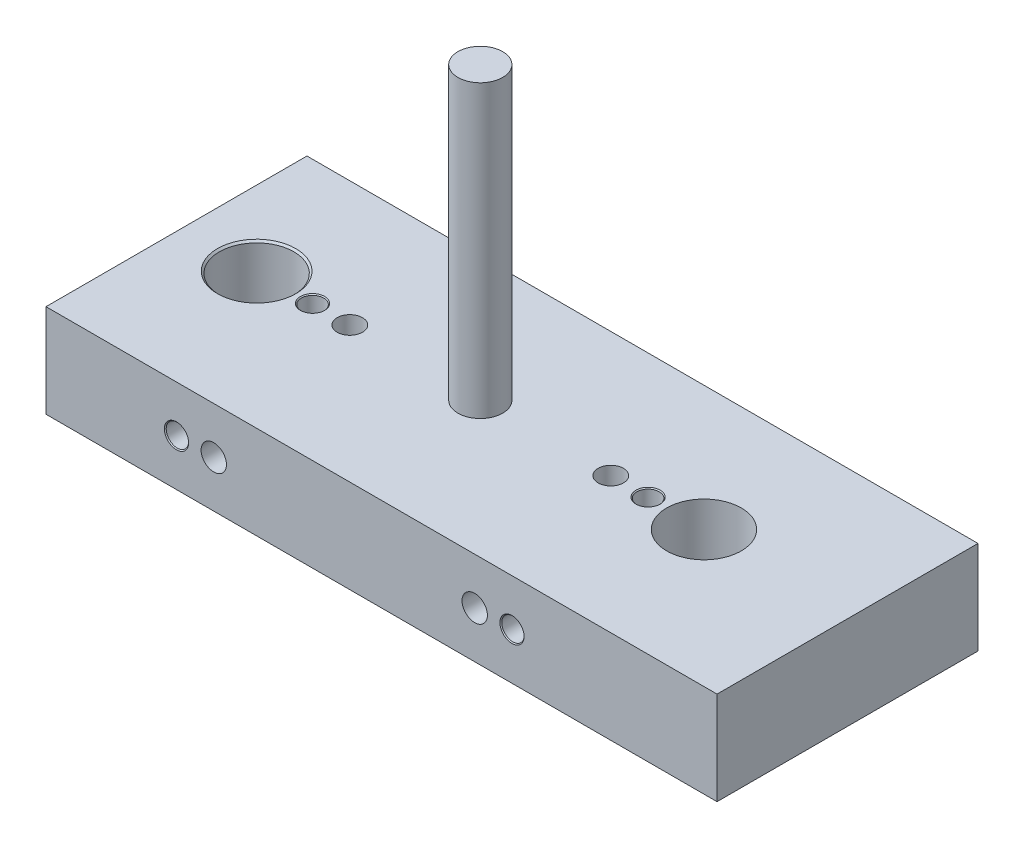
ISO-10303-21;
HEADER;
FILE_DESCRIPTION(('STEP AP214'),'2;1');
FILE_NAME('part.step','',(''),(''),'','','');
FILE_SCHEMA(('AUTOMOTIVE_DESIGN { 1 0 10303 214 1 1 1 1 }'));
ENDSEC;
DATA;
#1=APPLICATION_CONTEXT('core data for automotive mechanical design processes');
#2=APPLICATION_PROTOCOL_DEFINITION('international standard','automotive_design',2000,#1);
#3=PRODUCT_CONTEXT('',#1,'mechanical');
#4=PRODUCT('Part','Part','',(#3));
#5=PRODUCT_RELATED_PRODUCT_CATEGORY('part','',(#4));
#6=PRODUCT_DEFINITION_FORMATION('','',#4);
#7=PRODUCT_DEFINITION_CONTEXT('part definition',#1,'design');
#8=PRODUCT_DEFINITION('design','',#6,#7);
#9=PRODUCT_DEFINITION_SHAPE('','',#8);
#10=(LENGTH_UNIT() NAMED_UNIT(*) SI_UNIT(.MILLI.,.METRE.));
#11=(NAMED_UNIT(*) PLANE_ANGLE_UNIT() SI_UNIT($,.RADIAN.));
#12=(NAMED_UNIT(*) SI_UNIT($,.STERADIAN.) SOLID_ANGLE_UNIT());
#13=UNCERTAINTY_MEASURE_WITH_UNIT(LENGTH_MEASURE(1.E-05),#10,'distance_accuracy_value','');
#14=(GEOMETRIC_REPRESENTATION_CONTEXT(3) GLOBAL_UNCERTAINTY_ASSIGNED_CONTEXT((#13)) GLOBAL_UNIT_ASSIGNED_CONTEXT((#10,
#11,#12)) REPRESENTATION_CONTEXT('',''));
#15=CARTESIAN_POINT('',(0.,0.,0.));
#16=DIRECTION('',(0.,0.,1.));
#17=DIRECTION('',(1.,0.,0.));
#18=AXIS2_PLACEMENT_3D('',#15,#16,#17);
#19=CARTESIAN_POINT('',(0.,25.,-70.));
#20=DIRECTION('',(0.,-1.,0.));
#21=DIRECTION('',(0.,0.,-1.));
#22=AXIS2_PLACEMENT_3D('',#19,#20,#21);
#23=PLANE('',#22);
#24=CARTESIAN_POINT('',(140.,25.,-36.5));
#25=DIRECTION('',(0.,-1.,0.));
#26=DIRECTION('',(0.,0.,-1.));
#27=AXIS2_PLACEMENT_3D('',#24,#25,#26);
#28=CIRCLE('',#27,9.99999999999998);
#29=CARTESIAN_POINT('',(140.,25.,-46.5));
#30=VERTEX_POINT('',#29);
#31=EDGE_CURVE('E9179',#30,#30,#28,.T.);
#32=ORIENTED_EDGE('',*,*,#31,.T.);
#33=EDGE_LOOP('',(#32));
#34=FACE_BOUND('',#33,.T.);
#35=DIRECTION('',(0.,0.,1.));
#36=VECTOR('',#35,1.);
#37=CARTESIAN_POINT('',(0.,25.,0.));
#38=LINE('',#37,#36);
#39=CARTESIAN_POINT('',(0.,25.,-70.));
#40=VERTEX_POINT('',#39);
#41=CARTESIAN_POINT('',(0.,25.,0.));
#42=VERTEX_POINT('',#41);
#43=EDGE_CURVE('E9307',#40,#42,#38,.T.);
#44=ORIENTED_EDGE('',*,*,#43,.T.);
#45=DIRECTION('',(1.,0.,0.));
#46=VECTOR('',#45,1.);
#47=CARTESIAN_POINT('',(0.,25.,0.));
#48=LINE('',#47,#46);
#49=CARTESIAN_POINT('',(180.,25.,0.));
#50=VERTEX_POINT('',#49);
#51=EDGE_CURVE('E9305',#42,#50,#48,.T.);
#52=ORIENTED_EDGE('',*,*,#51,.T.);
#53=DIRECTION('',(0.,0.,-1.));
#54=VECTOR('',#53,1.);
#55=CARTESIAN_POINT('',(180.,25.,0.));
#56=LINE('',#55,#54);
#57=CARTESIAN_POINT('',(180.,25.,-70.));
#58=VERTEX_POINT('',#57);
#59=EDGE_CURVE('E9303',#50,#58,#56,.T.);
#60=ORIENTED_EDGE('',*,*,#59,.T.);
#61=DIRECTION('',(-1.,0.,0.));
#62=VECTOR('',#61,1.);
#63=CARTESIAN_POINT('',(0.,25.,-70.));
#64=LINE('',#63,#62);
#65=EDGE_CURVE('E9301',#58,#40,#64,.T.);
#66=ORIENTED_EDGE('',*,*,#65,.T.);
#67=EDGE_LOOP('',(#44,#52,#60,#66));
#68=FACE_BOUND('',#67,.T.);
#69=CARTESIAN_POINT('',(20.,25.,-36.5));
#70=DIRECTION('',(0.,-1.,0.));
#71=DIRECTION('',(0.,0.,-1.));
#72=AXIS2_PLACEMENT_3D('',#69,#70,#71);
#73=CIRCLE('',#72,10.5);
#74=CARTESIAN_POINT('',(20.,25.,-47.));
#75=VERTEX_POINT('',#74);
#76=EDGE_CURVE('E9328',#75,#75,#73,.T.);
#77=ORIENTED_EDGE('',*,*,#76,.T.);
#78=EDGE_LOOP('',(#77));
#79=FACE_BOUND('',#78,.T.);
#80=CARTESIAN_POINT('',(45.,25.,-36.5));
#81=DIRECTION('',(0.,-1.,0.));
#82=DIRECTION('',(0.,0.,-1.));
#83=AXIS2_PLACEMENT_3D('',#80,#81,#82);
#84=CIRCLE('',#83,3.39999999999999);
#85=CARTESIAN_POINT('',(45.,25.,-39.9));
#86=VERTEX_POINT('',#85);
#87=EDGE_CURVE('E9334',#86,#86,#84,.T.);
#88=ORIENTED_EDGE('',*,*,#87,.T.);
#89=EDGE_LOOP('',(#88));
#90=FACE_BOUND('',#89,.T.);
#91=CARTESIAN_POINT('',(115.,25.,-36.5));
#92=DIRECTION('',(0.,-1.,0.));
#93=DIRECTION('',(0.,0.,-1.));
#94=AXIS2_PLACEMENT_3D('',#91,#92,#93);
#95=CIRCLE('',#94,3.4);
#96=CARTESIAN_POINT('',(115.,25.,-39.9));
#97=VERTEX_POINT('',#96);
#98=EDGE_CURVE('E9340',#97,#97,#95,.T.);
#99=ORIENTED_EDGE('',*,*,#98,.T.);
#100=EDGE_LOOP('',(#99));
#101=FACE_BOUND('',#100,.T.);
#102=CARTESIAN_POINT('',(35.,25.,-36.5));
#103=DIRECTION('',(0.,-1.,0.));
#104=DIRECTION('',(0.,0.,-1.));
#105=AXIS2_PLACEMENT_3D('',#102,#103,#104);
#106=CIRCLE('',#105,3.25);
#107=CARTESIAN_POINT('',(35.,25.,-39.75));
#108=VERTEX_POINT('',#107);
#109=EDGE_CURVE('E9352',#108,#108,#106,.T.);
#110=ORIENTED_EDGE('',*,*,#109,.T.);
#111=EDGE_LOOP('',(#110));
#112=FACE_BOUND('',#111,.T.);
#113=CARTESIAN_POINT('',(125.,25.,-36.5));
#114=DIRECTION('',(0.,-1.,0.));
#115=DIRECTION('',(0.,0.,-1.));
#116=AXIS2_PLACEMENT_3D('',#113,#114,#115);
#117=CIRCLE('',#116,3.25);
#118=CARTESIAN_POINT('',(125.,25.,-39.75));
#119=VERTEX_POINT('',#118);
#120=EDGE_CURVE('E9364',#119,#119,#117,.T.);
#121=ORIENTED_EDGE('',*,*,#120,.T.);
#122=EDGE_LOOP('',(#121));
#123=FACE_BOUND('',#122,.T.);
#124=CARTESIAN_POINT('',(80.,25.,-36.5));
#125=DIRECTION('',(0.,-1.,0.));
#126=DIRECTION('',(0.,0.,-1.));
#127=AXIS2_PLACEMENT_3D('',#124,#125,#126);
#128=CIRCLE('',#127,6.);
#129=CARTESIAN_POINT('',(80.,25.,-42.5));
#130=VERTEX_POINT('',#129);
#131=EDGE_CURVE('E11',#130,#130,#128,.F.);
#132=ORIENTED_EDGE('',*,*,#131,.F.);
#133=EDGE_LOOP('',(#132));
#134=FACE_BOUND('',#133,.T.);
#135=ADVANCED_FACE('F9175',(#34,#68,#79,#90,#101,#112,#123,#134),#23,.F.);
#136=CARTESIAN_POINT('',(115.,0.,-36.5));
#137=DIRECTION('',(0.,-1.,0.));
#138=DIRECTION('',(0.,0.,-1.));
#139=AXIS2_PLACEMENT_3D('',#136,#137,#138);
#140=CYLINDRICAL_SURFACE('',#139,3.4);
#141=CARTESIAN_POINT('',(115.,0.,-36.5));
#142=DIRECTION('',(0.,-1.,0.));
#143=DIRECTION('',(0.,0.,-1.));
#144=AXIS2_PLACEMENT_3D('',#141,#142,#143);
#145=CIRCLE('',#144,3.4);
#146=CARTESIAN_POINT('',(115.,0.,-39.9));
#147=VERTEX_POINT('',#146);
#148=EDGE_CURVE('E9337',#147,#147,#145,.T.);
#149=ORIENTED_EDGE('',*,*,#148,.T.);
#150=EDGE_LOOP('',(#149));
#151=FACE_BOUND('',#150,.T.);
#152=CARTESIAN_POINT('',(115.,12.5,-36.5));
#153=DIRECTION('',(0.,-0.707106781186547,-0.707106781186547));
#154=DIRECTION('',(0.,-0.707106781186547,0.707106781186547));
#155=AXIS2_PLACEMENT_3D('',#152,#153,#154);
#156=ELLIPSE('',#155,4.80832611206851,3.39999999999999);
#157=CARTESIAN_POINT('',(111.6,12.5,-36.5));
#158=VERTEX_POINT('',#157);
#159=CARTESIAN_POINT('',(118.4,12.5,-36.5));
#160=VERTEX_POINT('',#159);
#161=EDGE_CURVE('E9190',#158,#160,#156,.F.);
#162=ORIENTED_EDGE('',*,*,#161,.T.);
#163=CARTESIAN_POINT('',(115.,12.5,-36.5));
#164=DIRECTION('',(0.,-0.707106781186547,0.707106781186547));
#165=DIRECTION('',(0.,-0.707106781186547,-0.707106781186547));
#166=AXIS2_PLACEMENT_3D('',#163,#164,#165);
#167=ELLIPSE('',#166,4.80832611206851,3.39999999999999);
#168=EDGE_CURVE('E9184',#160,#158,#167,.F.);
#169=ORIENTED_EDGE('',*,*,#168,.T.);
#170=EDGE_LOOP('',(#162,#169));
#171=FACE_BOUND('',#170,.T.);
#172=ADVANCED_FACE('F9253',(#151,#171),#140,.F.);
#173=CARTESIAN_POINT('',(45.,0.,-36.5));
#174=DIRECTION('',(0.,-1.,0.));
#175=DIRECTION('',(0.,0.,-1.));
#176=AXIS2_PLACEMENT_3D('',#173,#174,#175);
#177=CYLINDRICAL_SURFACE('',#176,3.4);
#178=CARTESIAN_POINT('',(45.,0.,-36.5));
#179=DIRECTION('',(0.,-1.,0.));
#180=DIRECTION('',(0.,0.,-1.));
#181=AXIS2_PLACEMENT_3D('',#178,#179,#180);
#182=CIRCLE('',#181,3.4);
#183=CARTESIAN_POINT('',(45.,0.,-39.9));
#184=VERTEX_POINT('',#183);
#185=EDGE_CURVE('E9331',#184,#184,#182,.T.);
#186=ORIENTED_EDGE('',*,*,#185,.T.);
#187=EDGE_LOOP('',(#186));
#188=FACE_BOUND('',#187,.T.);
#189=CARTESIAN_POINT('',(45.,12.5,-36.5));
#190=DIRECTION('',(0.,-0.707106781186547,-0.707106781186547));
#191=DIRECTION('',(0.,-0.707106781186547,0.707106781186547));
#192=AXIS2_PLACEMENT_3D('',#189,#190,#191);
#193=ELLIPSE('',#192,4.80832611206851,3.39999999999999);
#194=CARTESIAN_POINT('',(41.6,12.5,-36.5));
#195=VERTEX_POINT('',#194);
#196=CARTESIAN_POINT('',(48.4,12.5,-36.5));
#197=VERTEX_POINT('',#196);
#198=EDGE_CURVE('E9197',#195,#197,#193,.F.);
#199=ORIENTED_EDGE('',*,*,#198,.T.);
#200=CARTESIAN_POINT('',(45.,12.5,-36.5));
#201=DIRECTION('',(0.,-0.707106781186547,0.707106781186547));
#202=DIRECTION('',(0.,-0.707106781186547,-0.707106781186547));
#203=AXIS2_PLACEMENT_3D('',#200,#201,#202);
#204=ELLIPSE('',#203,4.80832611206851,3.39999999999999);
#205=EDGE_CURVE('E9251',#197,#195,#204,.F.);
#206=ORIENTED_EDGE('',*,*,#205,.T.);
#207=EDGE_LOOP('',(#199,#206));
#208=FACE_BOUND('',#207,.T.);
#209=ADVANCED_FACE('F9550',(#188,#208),#177,.F.);
#210=CARTESIAN_POINT('',(125.,0.,-36.5));
#211=DIRECTION('',(0.,-1.,0.));
#212=DIRECTION('',(0.,0.,-1.));
#213=AXIS2_PLACEMENT_3D('',#210,#211,#212);
#214=CYLINDRICAL_SURFACE('',#213,3.);
#215=CARTESIAN_POINT('',(125.,0.250000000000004,-36.5));
#216=DIRECTION('',(0.,-1.,0.));
#217=DIRECTION('',(0.,0.,-1.));
#218=AXIS2_PLACEMENT_3D('',#215,#216,#217);
#219=CIRCLE('',#218,3.);
#220=CARTESIAN_POINT('',(125.,0.250000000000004,-39.5));
#221=VERTEX_POINT('',#220);
#222=EDGE_CURVE('E9358',#221,#221,#219,.T.);
#223=ORIENTED_EDGE('',*,*,#222,.T.);
#224=EDGE_LOOP('',(#223));
#225=FACE_BOUND('',#224,.T.);
#226=CARTESIAN_POINT('',(125.,12.5,-36.5));
#227=DIRECTION('',(0.,-0.707106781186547,-0.707106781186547));
#228=DIRECTION('',(0.,-0.707106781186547,0.707106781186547));
#229=AXIS2_PLACEMENT_3D('',#226,#227,#228);
#230=ELLIPSE('',#229,4.24264068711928,3.);
#231=CARTESIAN_POINT('',(122.,12.5,-36.5));
#232=VERTEX_POINT('',#231);
#233=CARTESIAN_POINT('',(128.,12.5,-36.5));
#234=VERTEX_POINT('',#233);
#235=EDGE_CURVE('E9276',#232,#234,#230,.F.);
#236=ORIENTED_EDGE('',*,*,#235,.T.);
#237=CARTESIAN_POINT('',(125.,12.5,-36.5));
#238=DIRECTION('',(0.,-0.707106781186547,0.707106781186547));
#239=DIRECTION('',(0.,-0.707106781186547,-0.707106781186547));
#240=AXIS2_PLACEMENT_3D('',#237,#238,#239);
#241=ELLIPSE('',#240,4.24264068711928,3.);
#242=EDGE_CURVE('E9267',#234,#232,#241,.F.);
#243=ORIENTED_EDGE('',*,*,#242,.T.);
#244=EDGE_LOOP('',(#236,#243));
#245=FACE_BOUND('',#244,.T.);
#246=ADVANCED_FACE('F9526',(#225,#245),#214,.F.);
#247=CARTESIAN_POINT('',(35.,0.,-36.5));
#248=DIRECTION('',(0.,-1.,0.));
#249=DIRECTION('',(0.,0.,-1.));
#250=AXIS2_PLACEMENT_3D('',#247,#248,#249);
#251=CYLINDRICAL_SURFACE('',#250,3.);
#252=CARTESIAN_POINT('',(35.,0.250000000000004,-36.5));
#253=DIRECTION('',(0.,-1.,0.));
#254=DIRECTION('',(0.,0.,-1.));
#255=AXIS2_PLACEMENT_3D('',#252,#253,#254);
#256=CIRCLE('',#255,3.);
#257=CARTESIAN_POINT('',(35.,0.250000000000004,-39.5));
#258=VERTEX_POINT('',#257);
#259=EDGE_CURVE('E9346',#258,#258,#256,.T.);
#260=ORIENTED_EDGE('',*,*,#259,.T.);
#261=EDGE_LOOP('',(#260));
#262=FACE_BOUND('',#261,.T.);
#263=CARTESIAN_POINT('',(35.,12.5,-36.5));
#264=DIRECTION('',(0.,-0.707106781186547,-0.707106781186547));
#265=DIRECTION('',(0.,-0.707106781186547,0.707106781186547));
#266=AXIS2_PLACEMENT_3D('',#263,#264,#265);
#267=ELLIPSE('',#266,4.24264068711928,2.99999999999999);
#268=CARTESIAN_POINT('',(32.,12.5,-36.5));
#269=VERTEX_POINT('',#268);
#270=CARTESIAN_POINT('',(38.,12.5,-36.5));
#271=VERTEX_POINT('',#270);
#272=EDGE_CURVE('E9287',#269,#271,#267,.F.);
#273=ORIENTED_EDGE('',*,*,#272,.T.);
#274=CARTESIAN_POINT('',(35.,12.5,-36.5));
#275=DIRECTION('',(0.,-0.707106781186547,0.707106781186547));
#276=DIRECTION('',(0.,-0.707106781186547,-0.707106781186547));
#277=AXIS2_PLACEMENT_3D('',#274,#275,#276);
#278=ELLIPSE('',#277,4.24264068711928,2.99999999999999);
#279=EDGE_CURVE('E9278',#271,#269,#278,.F.);
#280=ORIENTED_EDGE('',*,*,#279,.T.);
#281=EDGE_LOOP('',(#273,#280));
#282=FACE_BOUND('',#281,.T.);
#283=ADVANCED_FACE('F9539',(#262,#282),#251,.F.);
#284=CARTESIAN_POINT('',(0.,25.,0.));
#285=DIRECTION('',(1.,0.,0.));
#286=DIRECTION('',(0.,0.,-1.));
#287=AXIS2_PLACEMENT_3D('',#284,#285,#286);
#288=PLANE('',#287);
#289=DIRECTION('',(0.,0.,1.));
#290=VECTOR('',#289,1.);
#291=CARTESIAN_POINT('',(0.,0.,0.));
#292=LINE('',#291,#290);
#293=CARTESIAN_POINT('',(0.,0.,-70.));
#294=VERTEX_POINT('',#293);
#295=CARTESIAN_POINT('',(0.,0.,0.));
#296=VERTEX_POINT('',#295);
#297=EDGE_CURVE('E9316',#294,#296,#292,.T.);
#298=ORIENTED_EDGE('',*,*,#297,.T.);
#299=DIRECTION('',(0.,-1.,0.));
#300=VECTOR('',#299,1.);
#301=CARTESIAN_POINT('',(0.,25.,0.));
#302=LINE('',#301,#300);
#303=EDGE_CURVE('E9289',#42,#296,#302,.T.);
#304=ORIENTED_EDGE('',*,*,#303,.F.);
#305=ORIENTED_EDGE('',*,*,#43,.F.);
#306=DIRECTION('',(0.,-1.,0.));
#307=VECTOR('',#306,1.);
#308=CARTESIAN_POINT('',(0.,25.,-70.));
#309=LINE('',#308,#307);
#310=EDGE_CURVE('E9298',#40,#294,#309,.T.);
#311=ORIENTED_EDGE('',*,*,#310,.T.);
#312=EDGE_LOOP('',(#298,#304,#305,#311));
#313=FACE_BOUND('',#312,.T.);
#314=ADVANCED_FACE('F9177',(#313),#288,.F.);
#315=CARTESIAN_POINT('',(0.,25.,0.));
#316=DIRECTION('',(0.,0.,-1.));
#317=DIRECTION('',(-1.,0.,0.));
#318=AXIS2_PLACEMENT_3D('',#315,#316,#317);
#319=PLANE('',#318);
#320=CARTESIAN_POINT('',(115.,12.5,0.));
#321=DIRECTION('',(0.,0.,1.));
#322=DIRECTION('',(1.,0.,0.));
#323=AXIS2_PLACEMENT_3D('',#320,#321,#322);
#324=CIRCLE('',#323,3.39999999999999);
#325=CARTESIAN_POINT('',(118.4,12.5,0.));
#326=VERTEX_POINT('',#325);
#327=EDGE_CURVE('E9397',#326,#326,#324,.T.);
#328=ORIENTED_EDGE('',*,*,#327,.F.);
#329=EDGE_LOOP('',(#328));
#330=FACE_BOUND('',#329,.T.);
#331=CARTESIAN_POINT('',(45.,12.5,0.));
#332=DIRECTION('',(0.,0.,1.));
#333=DIRECTION('',(1.,0.,0.));
#334=AXIS2_PLACEMENT_3D('',#331,#332,#333);
#335=CIRCLE('',#334,3.39999999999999);
#336=CARTESIAN_POINT('',(48.4,12.5,0.));
#337=VERTEX_POINT('',#336);
#338=EDGE_CURVE('E9391',#337,#337,#335,.T.);
#339=ORIENTED_EDGE('',*,*,#338,.F.);
#340=EDGE_LOOP('',(#339));
#341=FACE_BOUND('',#340,.T.);
#342=CARTESIAN_POINT('',(125.,12.5,0.));
#343=DIRECTION('',(0.,0.,1.));
#344=DIRECTION('',(1.,0.,0.));
#345=AXIS2_PLACEMENT_3D('',#342,#343,#344);
#346=CIRCLE('',#345,3.25);
#347=CARTESIAN_POINT('',(128.25,12.5,0.));
#348=VERTEX_POINT('',#347);
#349=EDGE_CURVE('E9379',#348,#348,#346,.T.);
#350=ORIENTED_EDGE('',*,*,#349,.F.);
#351=EDGE_LOOP('',(#350));
#352=FACE_BOUND('',#351,.T.);
#353=CARTESIAN_POINT('',(35.,12.5,0.));
#354=DIRECTION('',(0.,0.,1.));
#355=DIRECTION('',(1.,0.,0.));
#356=AXIS2_PLACEMENT_3D('',#353,#354,#355);
#357=CIRCLE('',#356,3.25);
#358=CARTESIAN_POINT('',(38.25,12.5,0.));
#359=VERTEX_POINT('',#358);
#360=EDGE_CURVE('E9367',#359,#359,#357,.T.);
#361=ORIENTED_EDGE('',*,*,#360,.F.);
#362=EDGE_LOOP('',(#361));
#363=FACE_BOUND('',#362,.T.);
#364=DIRECTION('',(1.,0.,0.));
#365=VECTOR('',#364,1.);
#366=CARTESIAN_POINT('',(0.,0.,0.));
#367=LINE('',#366,#365);
#368=CARTESIAN_POINT('',(180.,0.,0.));
#369=VERTEX_POINT('',#368);
#370=EDGE_CURVE('E9314',#296,#369,#367,.T.);
#371=ORIENTED_EDGE('',*,*,#370,.T.);
#372=DIRECTION('',(0.,-1.,0.));
#373=VECTOR('',#372,1.);
#374=CARTESIAN_POINT('',(180.,25.,0.));
#375=LINE('',#374,#373);
#376=EDGE_CURVE('E9292',#50,#369,#375,.T.);
#377=ORIENTED_EDGE('',*,*,#376,.F.);
#378=ORIENTED_EDGE('',*,*,#51,.F.);
#379=ORIENTED_EDGE('',*,*,#303,.T.);
#380=EDGE_LOOP('',(#371,#377,#378,#379));
#381=FACE_BOUND('',#380,.T.);
#382=ADVANCED_FACE('F9453',(#330,#341,#352,#363,#381),#319,.F.);
#383=CARTESIAN_POINT('',(180.,25.,0.));
#384=DIRECTION('',(-1.,0.,0.));
#385=DIRECTION('',(0.,0.,1.));
#386=AXIS2_PLACEMENT_3D('',#383,#384,#385);
#387=PLANE('',#386);
#388=DIRECTION('',(0.,0.,-1.));
#389=VECTOR('',#388,1.);
#390=CARTESIAN_POINT('',(180.,0.,0.));
#391=LINE('',#390,#389);
#392=CARTESIAN_POINT('',(180.,0.,-70.));
#393=VERTEX_POINT('',#392);
#394=EDGE_CURVE('E9312',#369,#393,#391,.T.);
#395=ORIENTED_EDGE('',*,*,#394,.T.);
#396=DIRECTION('',(0.,-1.,0.));
#397=VECTOR('',#396,1.);
#398=CARTESIAN_POINT('',(180.,25.,-70.));
#399=LINE('',#398,#397);
#400=EDGE_CURVE('E9295',#58,#393,#399,.T.);
#401=ORIENTED_EDGE('',*,*,#400,.F.);
#402=ORIENTED_EDGE('',*,*,#59,.F.);
#403=ORIENTED_EDGE('',*,*,#376,.T.);
#404=EDGE_LOOP('',(#395,#401,#402,#403));
#405=FACE_BOUND('',#404,.T.);
#406=ADVANCED_FACE('F9450',(#405),#387,.F.);
#407=CARTESIAN_POINT('',(0.,25.,-70.));
#408=DIRECTION('',(0.,0.,1.));
#409=DIRECTION('',(1.,0.,0.));
#410=AXIS2_PLACEMENT_3D('',#407,#408,#409);
#411=PLANE('',#410);
#412=CARTESIAN_POINT('',(115.,12.5,-70.));
#413=DIRECTION('',(0.,0.,1.));
#414=DIRECTION('',(1.,0.,0.));
#415=AXIS2_PLACEMENT_3D('',#412,#413,#414);
#416=CIRCLE('',#415,3.39999999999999);
#417=CARTESIAN_POINT('',(118.4,12.5,-70.));
#418=VERTEX_POINT('',#417);
#419=EDGE_CURVE('E9400',#418,#418,#416,.T.);
#420=ORIENTED_EDGE('',*,*,#419,.T.);
#421=EDGE_LOOP('',(#420));
#422=FACE_BOUND('',#421,.T.);
#423=CARTESIAN_POINT('',(45.,12.5,-70.));
#424=DIRECTION('',(0.,0.,1.));
#425=DIRECTION('',(1.,0.,0.));
#426=AXIS2_PLACEMENT_3D('',#423,#424,#425);
#427=CIRCLE('',#426,3.39999999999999);
#428=CARTESIAN_POINT('',(48.4,12.5,-70.));
#429=VERTEX_POINT('',#428);
#430=EDGE_CURVE('E9394',#429,#429,#427,.T.);
#431=ORIENTED_EDGE('',*,*,#430,.T.);
#432=EDGE_LOOP('',(#431));
#433=FACE_BOUND('',#432,.T.);
#434=CARTESIAN_POINT('',(125.,12.5,-70.));
#435=DIRECTION('',(0.,0.,1.));
#436=DIRECTION('',(1.,0.,0.));
#437=AXIS2_PLACEMENT_3D('',#434,#435,#436);
#438=CIRCLE('',#437,3.24999999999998);
#439=CARTESIAN_POINT('',(128.25,12.5,-70.));
#440=VERTEX_POINT('',#439);
#441=EDGE_CURVE('E9388',#440,#440,#438,.T.);
#442=ORIENTED_EDGE('',*,*,#441,.T.);
#443=EDGE_LOOP('',(#442));
#444=FACE_BOUND('',#443,.T.);
#445=CARTESIAN_POINT('',(35.,12.5,-70.));
#446=DIRECTION('',(0.,0.,1.));
#447=DIRECTION('',(1.,0.,0.));
#448=AXIS2_PLACEMENT_3D('',#445,#446,#447);
#449=CIRCLE('',#448,3.24999999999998);
#450=CARTESIAN_POINT('',(38.25,12.5,-70.));
#451=VERTEX_POINT('',#450);
#452=EDGE_CURVE('E9376',#451,#451,#449,.T.);
#453=ORIENTED_EDGE('',*,*,#452,.T.);
#454=EDGE_LOOP('',(#453));
#455=FACE_BOUND('',#454,.T.);
#456=DIRECTION('',(-1.,0.,0.));
#457=VECTOR('',#456,1.);
#458=CARTESIAN_POINT('',(0.,0.,-70.));
#459=LINE('',#458,#457);
#460=EDGE_CURVE('E9310',#393,#294,#459,.T.);
#461=ORIENTED_EDGE('',*,*,#460,.T.);
#462=ORIENTED_EDGE('',*,*,#310,.F.);
#463=ORIENTED_EDGE('',*,*,#65,.F.);
#464=ORIENTED_EDGE('',*,*,#400,.T.);
#465=EDGE_LOOP('',(#461,#462,#463,#464));
#466=FACE_BOUND('',#465,.T.);
#467=ADVANCED_FACE('F9426',(#422,#433,#444,#455,#466),#411,.F.);
#468=CARTESIAN_POINT('',(0.,0.,-70.));
#469=DIRECTION('',(0.,-1.,0.));
#470=DIRECTION('',(0.,0.,-1.));
#471=AXIS2_PLACEMENT_3D('',#468,#469,#470);
#472=PLANE('',#471);
#473=CARTESIAN_POINT('',(140.,0.,-36.5));
#474=DIRECTION('',(0.,-1.,0.));
#475=DIRECTION('',(0.,0.,-1.));
#476=AXIS2_PLACEMENT_3D('',#473,#474,#475);
#477=CIRCLE('',#476,10.5);
#478=CARTESIAN_POINT('',(140.,0.,-47.));
#479=VERTEX_POINT('',#478);
#480=EDGE_CURVE('E9406',#479,#479,#477,.T.);
#481=ORIENTED_EDGE('',*,*,#480,.F.);
#482=EDGE_LOOP('',(#481));
#483=FACE_BOUND('',#482,.T.);
#484=CARTESIAN_POINT('',(125.,0.,-36.5));
#485=DIRECTION('',(0.,-1.,0.));
#486=DIRECTION('',(0.,0.,-1.));
#487=AXIS2_PLACEMENT_3D('',#484,#485,#486);
#488=CIRCLE('',#487,3.25);
#489=CARTESIAN_POINT('',(125.,0.,-39.75));
#490=VERTEX_POINT('',#489);
#491=EDGE_CURVE('E9355',#490,#490,#488,.T.);
#492=ORIENTED_EDGE('',*,*,#491,.F.);
#493=EDGE_LOOP('',(#492));
#494=FACE_BOUND('',#493,.T.);
#495=CARTESIAN_POINT('',(35.,0.,-36.5));
#496=DIRECTION('',(0.,-1.,0.));
#497=DIRECTION('',(0.,0.,-1.));
#498=AXIS2_PLACEMENT_3D('',#495,#496,#497);
#499=CIRCLE('',#498,3.25);
#500=CARTESIAN_POINT('',(35.,0.,-39.75));
#501=VERTEX_POINT('',#500);
#502=EDGE_CURVE('E9343',#501,#501,#499,.T.);
#503=ORIENTED_EDGE('',*,*,#502,.F.);
#504=EDGE_LOOP('',(#503));
#505=FACE_BOUND('',#504,.T.);
#506=ORIENTED_EDGE('',*,*,#148,.F.);
#507=EDGE_LOOP('',(#506));
#508=FACE_BOUND('',#507,.T.);
#509=ORIENTED_EDGE('',*,*,#185,.F.);
#510=EDGE_LOOP('',(#509));
#511=FACE_BOUND('',#510,.T.);
#512=CARTESIAN_POINT('',(20.,0.,-36.5));
#513=DIRECTION('',(0.,-1.,0.));
#514=DIRECTION('',(0.,0.,-1.));
#515=AXIS2_PLACEMENT_3D('',#512,#513,#514);
#516=CIRCLE('',#515,10.5);
#517=CARTESIAN_POINT('',(20.,0.,-47.));
#518=VERTEX_POINT('',#517);
#519=EDGE_CURVE('E9319',#518,#518,#516,.T.);
#520=ORIENTED_EDGE('',*,*,#519,.F.);
#521=EDGE_LOOP('',(#520));
#522=FACE_BOUND('',#521,.T.);
#523=ORIENTED_EDGE('',*,*,#297,.F.);
#524=ORIENTED_EDGE('',*,*,#460,.F.);
#525=ORIENTED_EDGE('',*,*,#394,.F.);
#526=ORIENTED_EDGE('',*,*,#370,.F.);
#527=EDGE_LOOP('',(#523,#524,#525,#526));
#528=FACE_BOUND('',#527,.T.);
#529=ADVANCED_FACE('F9422',(#483,#494,#505,#508,#511,#522,#528),#472,.T.);
#530=CARTESIAN_POINT('',(20.,0.,-36.5));
#531=DIRECTION('',(0.,-1.,0.));
#532=DIRECTION('',(0.,0.,-1.));
#533=AXIS2_PLACEMENT_3D('',#530,#531,#532);
#534=CONICAL_SURFACE('',#533,10.5,0.785398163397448);
#535=CARTESIAN_POINT('',(20.,0.500000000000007,-36.5));
#536=DIRECTION('',(0.,-1.,0.));
#537=DIRECTION('',(0.,0.,-1.));
#538=AXIS2_PLACEMENT_3D('',#535,#536,#537);
#539=CIRCLE('',#538,9.99999999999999);
#540=CARTESIAN_POINT('',(20.,0.500000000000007,-46.5));
#541=VERTEX_POINT('',#540);
#542=EDGE_CURVE('E9322',#541,#541,#539,.T.);
#543=ORIENTED_EDGE('',*,*,#542,.F.);
#544=EDGE_LOOP('',(#543));
#545=FACE_BOUND('',#544,.T.);
#546=ORIENTED_EDGE('',*,*,#519,.T.);
#547=EDGE_LOOP('',(#546));
#548=FACE_BOUND('',#547,.T.);
#549=ADVANCED_FACE('F9425',(#545,#548),#534,.F.);
#550=CARTESIAN_POINT('',(20.,0.,-36.5));
#551=DIRECTION('',(0.,-1.,0.));
#552=DIRECTION('',(0.,0.,-1.));
#553=AXIS2_PLACEMENT_3D('',#550,#551,#552);
#554=CYLINDRICAL_SURFACE('',#553,9.99999999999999);
#555=CARTESIAN_POINT('',(20.,24.5,-36.5));
#556=DIRECTION('',(0.,-1.,0.));
#557=DIRECTION('',(0.,0.,-1.));
#558=AXIS2_PLACEMENT_3D('',#555,#556,#557);
#559=CIRCLE('',#558,9.99999999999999);
#560=CARTESIAN_POINT('',(20.,24.5,-46.5));
#561=VERTEX_POINT('',#560);
#562=EDGE_CURVE('E9325',#561,#561,#559,.T.);
#563=ORIENTED_EDGE('',*,*,#562,.F.);
#564=EDGE_LOOP('',(#563));
#565=FACE_BOUND('',#564,.T.);
#566=ORIENTED_EDGE('',*,*,#542,.T.);
#567=EDGE_LOOP('',(#566));
#568=FACE_BOUND('',#567,.T.);
#569=ADVANCED_FACE('F9553',(#565,#568),#554,.F.);
#570=CARTESIAN_POINT('',(20.,24.5,-36.5));
#571=DIRECTION('',(0.,1.,0.));
#572=DIRECTION('',(0.,0.,1.));
#573=AXIS2_PLACEMENT_3D('',#570,#571,#572);
#574=CONICAL_SURFACE('',#573,9.99999999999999,0.785398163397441);
#575=ORIENTED_EDGE('',*,*,#76,.F.);
#576=EDGE_LOOP('',(#575));
#577=FACE_BOUND('',#576,.T.);
#578=ORIENTED_EDGE('',*,*,#562,.T.);
#579=EDGE_LOOP('',(#578));
#580=FACE_BOUND('',#579,.T.);
#581=ADVANCED_FACE('F9548',(#577,#580),#574,.F.);
#582=CARTESIAN_POINT('',(45.,12.5,-36.5));
#583=DIRECTION('',(0.,-0.707106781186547,-0.707106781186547));
#584=DIRECTION('',(0.,-0.707106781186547,0.707106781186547));
#585=AXIS2_PLACEMENT_3D('',#582,#583,#584);
#586=ELLIPSE('',#585,4.80832611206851,3.39999999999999);
#587=EDGE_CURVE('E9263',#195,#197,#586,.T.);
#588=ORIENTED_EDGE('',*,*,#587,.T.);
#589=CARTESIAN_POINT('',(45.,12.5,-36.5));
#590=DIRECTION('',(0.,-0.707106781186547,0.707106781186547));
#591=DIRECTION('',(0.,-0.707106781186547,-0.707106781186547));
#592=AXIS2_PLACEMENT_3D('',#589,#590,#591);
#593=ELLIPSE('',#592,4.80832611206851,3.39999999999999);
#594=EDGE_CURVE('E9260',#197,#195,#593,.T.);
#595=ORIENTED_EDGE('',*,*,#594,.T.);
#596=EDGE_LOOP('',(#588,#595));
#597=FACE_BOUND('',#596,.T.);
#598=ORIENTED_EDGE('',*,*,#87,.F.);
#599=EDGE_LOOP('',(#598));
#600=FACE_BOUND('',#599,.T.);
#601=ADVANCED_FACE('F9545',(#597,#600),#177,.F.);
#602=CARTESIAN_POINT('',(115.,12.5,-36.5));
#603=DIRECTION('',(0.,-0.707106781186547,-0.707106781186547));
#604=DIRECTION('',(0.,-0.707106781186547,0.707106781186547));
#605=AXIS2_PLACEMENT_3D('',#602,#603,#604);
#606=ELLIPSE('',#605,4.80832611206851,3.39999999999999);
#607=EDGE_CURVE('E9243',#158,#160,#606,.T.);
#608=ORIENTED_EDGE('',*,*,#607,.T.);
#609=CARTESIAN_POINT('',(115.,12.5,-36.5));
#610=DIRECTION('',(0.,-0.707106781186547,0.707106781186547));
#611=DIRECTION('',(0.,-0.707106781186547,-0.707106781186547));
#612=AXIS2_PLACEMENT_3D('',#609,#610,#611);
#613=ELLIPSE('',#612,4.80832611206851,3.39999999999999);
#614=EDGE_CURVE('E9247',#160,#158,#613,.T.);
#615=ORIENTED_EDGE('',*,*,#614,.T.);
#616=EDGE_LOOP('',(#608,#615));
#617=FACE_BOUND('',#616,.T.);
#618=ORIENTED_EDGE('',*,*,#98,.F.);
#619=EDGE_LOOP('',(#618));
#620=FACE_BOUND('',#619,.T.);
#621=ADVANCED_FACE('F9255',(#617,#620),#140,.F.);
#622=CARTESIAN_POINT('',(35.,0.,-36.5));
#623=DIRECTION('',(0.,-1.,0.));
#624=DIRECTION('',(0.,0.,-1.));
#625=AXIS2_PLACEMENT_3D('',#622,#623,#624);
#626=CONICAL_SURFACE('',#625,3.25,0.785398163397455);
#627=ORIENTED_EDGE('',*,*,#259,.F.);
#628=EDGE_LOOP('',(#627));
#629=FACE_BOUND('',#628,.T.);
#630=ORIENTED_EDGE('',*,*,#502,.T.);
#631=EDGE_LOOP('',(#630));
#632=FACE_BOUND('',#631,.T.);
#633=ADVANCED_FACE('F9537',(#629,#632),#626,.F.);
#634=CARTESIAN_POINT('',(35.,12.5,-36.5));
#635=DIRECTION('',(0.,-0.707106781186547,-0.707106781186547));
#636=DIRECTION('',(0.,-0.707106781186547,0.707106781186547));
#637=AXIS2_PLACEMENT_3D('',#634,#635,#636);
#638=ELLIPSE('',#637,4.24264068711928,2.99999999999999);
#639=EDGE_CURVE('E9284',#269,#271,#638,.T.);
#640=ORIENTED_EDGE('',*,*,#639,.T.);
#641=CARTESIAN_POINT('',(35.,12.5,-36.5));
#642=DIRECTION('',(0.,-0.707106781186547,0.707106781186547));
#643=DIRECTION('',(0.,-0.707106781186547,-0.707106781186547));
#644=AXIS2_PLACEMENT_3D('',#641,#642,#643);
#645=ELLIPSE('',#644,4.24264068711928,2.99999999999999);
#646=EDGE_CURVE('E9281',#271,#269,#645,.T.);
#647=ORIENTED_EDGE('',*,*,#646,.T.);
#648=EDGE_LOOP('',(#640,#647));
#649=FACE_BOUND('',#648,.T.);
#650=CARTESIAN_POINT('',(35.,24.75,-36.5));
#651=DIRECTION('',(0.,-1.,0.));
#652=DIRECTION('',(0.,0.,-1.));
#653=AXIS2_PLACEMENT_3D('',#650,#651,#652);
#654=CIRCLE('',#653,3.);
#655=CARTESIAN_POINT('',(35.,24.75,-39.5));
#656=VERTEX_POINT('',#655);
#657=EDGE_CURVE('E9349',#656,#656,#654,.T.);
#658=ORIENTED_EDGE('',*,*,#657,.F.);
#659=EDGE_LOOP('',(#658));
#660=FACE_BOUND('',#659,.T.);
#661=ADVANCED_FACE('F9533',(#649,#660),#251,.F.);
#662=CARTESIAN_POINT('',(35.,24.75,-36.5));
#663=DIRECTION('',(0.,1.,0.));
#664=DIRECTION('',(0.,0.,1.));
#665=AXIS2_PLACEMENT_3D('',#662,#663,#664);
#666=CONICAL_SURFACE('',#665,3.,0.785398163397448);
#667=ORIENTED_EDGE('',*,*,#109,.F.);
#668=EDGE_LOOP('',(#667));
#669=FACE_BOUND('',#668,.T.);
#670=ORIENTED_EDGE('',*,*,#657,.T.);
#671=EDGE_LOOP('',(#670));
#672=FACE_BOUND('',#671,.T.);
#673=ADVANCED_FACE('F9529',(#669,#672),#666,.F.);
#674=CARTESIAN_POINT('',(125.,0.,-36.5));
#675=DIRECTION('',(0.,-1.,0.));
#676=DIRECTION('',(0.,0.,-1.));
#677=AXIS2_PLACEMENT_3D('',#674,#675,#676);
#678=CONICAL_SURFACE('',#677,3.25,0.785398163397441);
#679=ORIENTED_EDGE('',*,*,#222,.F.);
#680=EDGE_LOOP('',(#679));
#681=FACE_BOUND('',#680,.T.);
#682=ORIENTED_EDGE('',*,*,#491,.T.);
#683=EDGE_LOOP('',(#682));
#684=FACE_BOUND('',#683,.T.);
#685=ADVANCED_FACE('F9524',(#681,#684),#678,.F.);
#686=CARTESIAN_POINT('',(125.,12.5,-36.5));
#687=DIRECTION('',(0.,-0.707106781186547,-0.707106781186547));
#688=DIRECTION('',(0.,-0.707106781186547,0.707106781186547));
#689=AXIS2_PLACEMENT_3D('',#686,#687,#688);
#690=ELLIPSE('',#689,4.24264068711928,3.);
#691=EDGE_CURVE('E9273',#232,#234,#690,.T.);
#692=ORIENTED_EDGE('',*,*,#691,.T.);
#693=CARTESIAN_POINT('',(125.,12.5,-36.5));
#694=DIRECTION('',(0.,-0.707106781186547,0.707106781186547));
#695=DIRECTION('',(0.,-0.707106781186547,-0.707106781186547));
#696=AXIS2_PLACEMENT_3D('',#693,#694,#695);
#697=ELLIPSE('',#696,4.24264068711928,3.);
#698=EDGE_CURVE('E9270',#234,#232,#697,.T.);
#699=ORIENTED_EDGE('',*,*,#698,.T.);
#700=EDGE_LOOP('',(#692,#699));
#701=FACE_BOUND('',#700,.T.);
#702=CARTESIAN_POINT('',(125.,24.75,-36.5));
#703=DIRECTION('',(0.,-1.,0.));
#704=DIRECTION('',(0.,0.,-1.));
#705=AXIS2_PLACEMENT_3D('',#702,#703,#704);
#706=CIRCLE('',#705,3.);
#707=CARTESIAN_POINT('',(125.,24.75,-39.5));
#708=VERTEX_POINT('',#707);
#709=EDGE_CURVE('E9361',#708,#708,#706,.T.);
#710=ORIENTED_EDGE('',*,*,#709,.F.);
#711=EDGE_LOOP('',(#710));
#712=FACE_BOUND('',#711,.T.);
#713=ADVANCED_FACE('F9520',(#701,#712),#214,.F.);
#714=CARTESIAN_POINT('',(125.,24.75,-36.5));
#715=DIRECTION('',(0.,1.,0.));
#716=DIRECTION('',(0.,0.,1.));
#717=AXIS2_PLACEMENT_3D('',#714,#715,#716);
#718=CONICAL_SURFACE('',#717,3.,0.785398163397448);
#719=ORIENTED_EDGE('',*,*,#120,.F.);
#720=EDGE_LOOP('',(#719));
#721=FACE_BOUND('',#720,.T.);
#722=ORIENTED_EDGE('',*,*,#709,.T.);
#723=EDGE_LOOP('',(#722));
#724=FACE_BOUND('',#723,.T.);
#725=ADVANCED_FACE('F9517',(#721,#724),#718,.F.);
#726=CARTESIAN_POINT('',(35.,12.5,0.));
#727=DIRECTION('',(0.,0.,1.));
#728=DIRECTION('',(1.,0.,0.));
#729=AXIS2_PLACEMENT_3D('',#726,#727,#728);
#730=CYLINDRICAL_SURFACE('',#729,2.99999999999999);
#731=CARTESIAN_POINT('',(35.,12.5,-0.250000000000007));
#732=DIRECTION('',(0.,0.,1.));
#733=DIRECTION('',(1.,0.,0.));
#734=AXIS2_PLACEMENT_3D('',#731,#732,#733);
#735=CIRCLE('',#734,3.);
#736=CARTESIAN_POINT('',(38.,12.5,-0.250000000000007));
#737=VERTEX_POINT('',#736);
#738=EDGE_CURVE('E9370',#737,#737,#735,.T.);
#739=ORIENTED_EDGE('',*,*,#738,.T.);
#740=EDGE_LOOP('',(#739));
#741=FACE_BOUND('',#740,.T.);
#742=ORIENTED_EDGE('',*,*,#272,.F.);
#743=ORIENTED_EDGE('',*,*,#646,.F.);
#744=EDGE_LOOP('',(#742,#743));
#745=FACE_BOUND('',#744,.T.);
#746=ADVANCED_FACE('F9513',(#741,#745),#730,.F.);
#747=CARTESIAN_POINT('',(35.,12.5,0.));
#748=DIRECTION('',(0.,0.,1.));
#749=DIRECTION('',(1.,0.,0.));
#750=AXIS2_PLACEMENT_3D('',#747,#748,#749);
#751=CONICAL_SURFACE('',#750,3.25,0.785398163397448);
#752=ORIENTED_EDGE('',*,*,#738,.F.);
#753=EDGE_LOOP('',(#752));
#754=FACE_BOUND('',#753,.T.);
#755=ORIENTED_EDGE('',*,*,#360,.T.);
#756=EDGE_LOOP('',(#755));
#757=FACE_BOUND('',#756,.T.);
#758=ADVANCED_FACE('F9511',(#754,#757),#751,.F.);
#759=CARTESIAN_POINT('',(35.,12.5,-69.75));
#760=DIRECTION('',(0.,0.,1.));
#761=DIRECTION('',(1.,0.,0.));
#762=AXIS2_PLACEMENT_3D('',#759,#760,#761);
#763=CIRCLE('',#762,2.99999999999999);
#764=CARTESIAN_POINT('',(38.,12.5,-69.75));
#765=VERTEX_POINT('',#764);
#766=EDGE_CURVE('E9373',#765,#765,#763,.T.);
#767=ORIENTED_EDGE('',*,*,#766,.F.);
#768=EDGE_LOOP('',(#767));
#769=FACE_BOUND('',#768,.T.);
#770=ORIENTED_EDGE('',*,*,#639,.F.);
#771=ORIENTED_EDGE('',*,*,#279,.F.);
#772=EDGE_LOOP('',(#770,#771));
#773=FACE_BOUND('',#772,.T.);
#774=ADVANCED_FACE('F9507',(#769,#773),#730,.F.);
#775=CARTESIAN_POINT('',(35.,12.5,-69.75));
#776=DIRECTION('',(0.,0.,-1.));
#777=DIRECTION('',(-1.,0.,0.));
#778=AXIS2_PLACEMENT_3D('',#775,#776,#777);
#779=CONICAL_SURFACE('',#778,2.99999999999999,0.785398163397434);
#780=ORIENTED_EDGE('',*,*,#452,.F.);
#781=EDGE_LOOP('',(#780));
#782=FACE_BOUND('',#781,.T.);
#783=ORIENTED_EDGE('',*,*,#766,.T.);
#784=EDGE_LOOP('',(#783));
#785=FACE_BOUND('',#784,.T.);
#786=ADVANCED_FACE('F9504',(#782,#785),#779,.F.);
#787=CARTESIAN_POINT('',(125.,12.5,0.));
#788=DIRECTION('',(0.,0.,1.));
#789=DIRECTION('',(1.,0.,0.));
#790=AXIS2_PLACEMENT_3D('',#787,#788,#789);
#791=CYLINDRICAL_SURFACE('',#790,2.99999999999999);
#792=CARTESIAN_POINT('',(125.,12.5,-0.250000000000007));
#793=DIRECTION('',(0.,0.,1.));
#794=DIRECTION('',(1.,0.,0.));
#795=AXIS2_PLACEMENT_3D('',#792,#793,#794);
#796=CIRCLE('',#795,3.);
#797=CARTESIAN_POINT('',(128.,12.5,-0.250000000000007));
#798=VERTEX_POINT('',#797);
#799=EDGE_CURVE('E9382',#798,#798,#796,.T.);
#800=ORIENTED_EDGE('',*,*,#799,.T.);
#801=EDGE_LOOP('',(#800));
#802=FACE_BOUND('',#801,.T.);
#803=ORIENTED_EDGE('',*,*,#235,.F.);
#804=ORIENTED_EDGE('',*,*,#698,.F.);
#805=EDGE_LOOP('',(#803,#804));
#806=FACE_BOUND('',#805,.T.);
#807=ADVANCED_FACE('F9500',(#802,#806),#791,.F.);
#808=CARTESIAN_POINT('',(125.,12.5,0.));
#809=DIRECTION('',(0.,0.,1.));
#810=DIRECTION('',(1.,0.,0.));
#811=AXIS2_PLACEMENT_3D('',#808,#809,#810);
#812=CONICAL_SURFACE('',#811,3.25,0.785398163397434);
#813=ORIENTED_EDGE('',*,*,#799,.F.);
#814=EDGE_LOOP('',(#813));
#815=FACE_BOUND('',#814,.T.);
#816=ORIENTED_EDGE('',*,*,#349,.T.);
#817=EDGE_LOOP('',(#816));
#818=FACE_BOUND('',#817,.T.);
#819=ADVANCED_FACE('F9498',(#815,#818),#812,.F.);
#820=CARTESIAN_POINT('',(125.,12.5,-69.75));
#821=DIRECTION('',(0.,0.,1.));
#822=DIRECTION('',(1.,0.,0.));
#823=AXIS2_PLACEMENT_3D('',#820,#821,#822);
#824=CIRCLE('',#823,2.99999999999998);
#825=CARTESIAN_POINT('',(128.,12.5,-69.75));
#826=VERTEX_POINT('',#825);
#827=EDGE_CURVE('E9385',#826,#826,#824,.T.);
#828=ORIENTED_EDGE('',*,*,#827,.F.);
#829=EDGE_LOOP('',(#828));
#830=FACE_BOUND('',#829,.T.);
#831=ORIENTED_EDGE('',*,*,#691,.F.);
#832=ORIENTED_EDGE('',*,*,#242,.F.);
#833=EDGE_LOOP('',(#831,#832));
#834=FACE_BOUND('',#833,.T.);
#835=ADVANCED_FACE('F9494',(#830,#834),#791,.F.);
#836=CARTESIAN_POINT('',(125.,12.5,-69.75));
#837=DIRECTION('',(0.,0.,-1.));
#838=DIRECTION('',(-1.,0.,0.));
#839=AXIS2_PLACEMENT_3D('',#836,#837,#838);
#840=CONICAL_SURFACE('',#839,2.99999999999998,0.785398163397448);
#841=ORIENTED_EDGE('',*,*,#441,.F.);
#842=EDGE_LOOP('',(#841));
#843=FACE_BOUND('',#842,.T.);
#844=ORIENTED_EDGE('',*,*,#827,.T.);
#845=EDGE_LOOP('',(#844));
#846=FACE_BOUND('',#845,.T.);
#847=ADVANCED_FACE('F9491',(#843,#846),#840,.F.);
#848=CARTESIAN_POINT('',(45.,12.5,0.));
#849=DIRECTION('',(0.,0.,1.));
#850=DIRECTION('',(1.,0.,0.));
#851=AXIS2_PLACEMENT_3D('',#848,#849,#850);
#852=CYLINDRICAL_SURFACE('',#851,3.39999999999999);
#853=ORIENTED_EDGE('',*,*,#338,.T.);
#854=EDGE_LOOP('',(#853));
#855=FACE_BOUND('',#854,.T.);
#856=ORIENTED_EDGE('',*,*,#198,.F.);
#857=ORIENTED_EDGE('',*,*,#594,.F.);
#858=EDGE_LOOP('',(#856,#857));
#859=FACE_BOUND('',#858,.T.);
#860=ADVANCED_FACE('F9489',(#855,#859),#852,.F.);
#861=ORIENTED_EDGE('',*,*,#430,.F.);
#862=EDGE_LOOP('',(#861));
#863=FACE_BOUND('',#862,.T.);
#864=ORIENTED_EDGE('',*,*,#587,.F.);
#865=ORIENTED_EDGE('',*,*,#205,.F.);
#866=EDGE_LOOP('',(#864,#865));
#867=FACE_BOUND('',#866,.T.);
#868=ADVANCED_FACE('F9486',(#863,#867),#852,.F.);
#869=CARTESIAN_POINT('',(115.,12.5,0.));
#870=DIRECTION('',(0.,0.,1.));
#871=DIRECTION('',(1.,0.,0.));
#872=AXIS2_PLACEMENT_3D('',#869,#870,#871);
#873=CYLINDRICAL_SURFACE('',#872,3.39999999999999);
#874=ORIENTED_EDGE('',*,*,#327,.T.);
#875=EDGE_LOOP('',(#874));
#876=FACE_BOUND('',#875,.T.);
#877=ORIENTED_EDGE('',*,*,#161,.F.);
#878=ORIENTED_EDGE('',*,*,#614,.F.);
#879=EDGE_LOOP('',(#877,#878));
#880=FACE_BOUND('',#879,.T.);
#881=ADVANCED_FACE('F9250',(#876,#880),#873,.F.);
#882=ORIENTED_EDGE('',*,*,#419,.F.);
#883=EDGE_LOOP('',(#882));
#884=FACE_BOUND('',#883,.T.);
#885=ORIENTED_EDGE('',*,*,#607,.F.);
#886=ORIENTED_EDGE('',*,*,#168,.F.);
#887=EDGE_LOOP('',(#885,#886));
#888=FACE_BOUND('',#887,.T.);
#889=ADVANCED_FACE('F9244',(#884,#888),#873,.F.);
#890=CARTESIAN_POINT('',(80.,103.,-36.5));
#891=DIRECTION('',(0.,-1.,0.));
#892=DIRECTION('',(0.,0.,-1.));
#893=AXIS2_PLACEMENT_3D('',#890,#891,#892);
#894=CYLINDRICAL_SURFACE('',#893,6.);
#895=CARTESIAN_POINT('',(80.,103.,-36.5));
#896=DIRECTION('',(0.,1.,0.));
#897=DIRECTION('',(0.,0.,1.));
#898=AXIS2_PLACEMENT_3D('',#895,#896,#897);
#899=CIRCLE('',#898,6.);
#900=CARTESIAN_POINT('',(80.,103.,-30.5));
#901=VERTEX_POINT('',#900);
#902=EDGE_CURVE('E9403',#901,#901,#899,.T.);
#903=ORIENTED_EDGE('',*,*,#902,.F.);
#904=EDGE_LOOP('',(#903));
#905=FACE_BOUND('',#904,.T.);
#906=ORIENTED_EDGE('',*,*,#131,.T.);
#907=EDGE_LOOP('',(#906));
#908=FACE_BOUND('',#907,.T.);
#909=ADVANCED_FACE('F9471',(#905,#908),#894,.T.);
#910=CARTESIAN_POINT('',(80.,103.,-36.5));
#911=DIRECTION('',(0.,1.,0.));
#912=DIRECTION('',(0.,0.,1.));
#913=AXIS2_PLACEMENT_3D('',#910,#911,#912);
#914=PLANE('',#913);
#915=ORIENTED_EDGE('',*,*,#902,.T.);
#916=EDGE_LOOP('',(#915));
#917=FACE_BOUND('',#916,.T.);
#918=ADVANCED_FACE('F9473',(#917),#914,.T.);
#919=CARTESIAN_POINT('',(140.,0.,-36.5));
#920=DIRECTION('',(0.,-1.,0.));
#921=DIRECTION('',(0.,0.,-1.));
#922=AXIS2_PLACEMENT_3D('',#919,#920,#921);
#923=CYLINDRICAL_SURFACE('',#922,9.99999999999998);
#924=CARTESIAN_POINT('',(140.,0.5,-36.5));
#925=DIRECTION('',(0.,-1.,0.));
#926=DIRECTION('',(0.,0.,-1.));
#927=AXIS2_PLACEMENT_3D('',#924,#925,#926);
#928=CIRCLE('',#927,9.99999999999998);
#929=CARTESIAN_POINT('',(140.,0.5,-46.5));
#930=VERTEX_POINT('',#929);
#931=EDGE_CURVE('E9409',#930,#930,#928,.T.);
#932=ORIENTED_EDGE('',*,*,#931,.T.);
#933=EDGE_LOOP('',(#932));
#934=FACE_BOUND('',#933,.T.);
#935=ORIENTED_EDGE('',*,*,#31,.F.);
#936=EDGE_LOOP('',(#935));
#937=FACE_BOUND('',#936,.T.);
#938=ADVANCED_FACE('F9413',(#934,#937),#923,.F.);
#939=CARTESIAN_POINT('',(140.,0.,-36.5));
#940=DIRECTION('',(0.,-1.,0.));
#941=DIRECTION('',(0.,0.,-1.));
#942=AXIS2_PLACEMENT_3D('',#939,#940,#941);
#943=CONICAL_SURFACE('',#942,10.5,0.785398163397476);
#944=ORIENTED_EDGE('',*,*,#931,.F.);
#945=EDGE_LOOP('',(#944));
#946=FACE_BOUND('',#945,.T.);
#947=ORIENTED_EDGE('',*,*,#480,.T.);
#948=EDGE_LOOP('',(#947));
#949=FACE_BOUND('',#948,.T.);
#950=ADVANCED_FACE('F9416',(#946,#949),#943,.F.);
#951=CLOSED_SHELL('',(#135,#172,#209,#246,#283,#314,#382,#406,#467,#529,#549,#569,#581,#601,
#621,#633,#661,#673,#685,#713,#725,#746,#758,#774,#786,#807,#819,#835,#847,#860,#868,#881,#889,
#909,#918,#938,#950));
#952=MANIFOLD_SOLID_BREP('B2',#951);
#953=ADVANCED_BREP_SHAPE_REPRESENTATION('',(#18,#952),#14);
#954=SHAPE_DEFINITION_REPRESENTATION(#9,#953);
ENDSEC;
END-ISO-10303-21;
